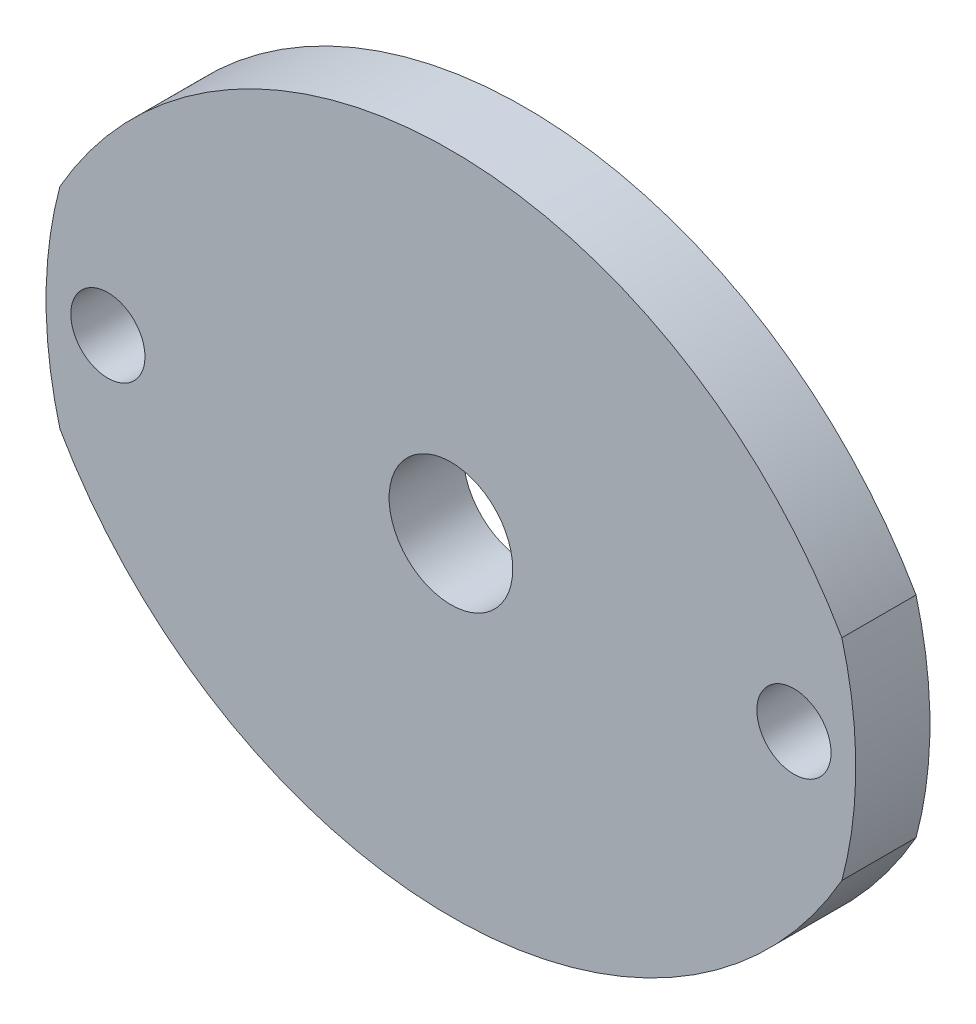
from build123d import *

# Parameters (mm, degrees)
SKETCH1_R           = 2.5
SKETCH1_R_2         = 1.5
BOSS_EXTRUDE1_DEPTH = 3


with BuildPart() as part:
    # Sketch1 → Boss-Extrude1 (new body)
    with BuildSketch(Plane.XY):
        with BuildLine():
            ThreePointArc((2.386362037, 4.024192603), (1.825187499, -0.22593084), (2.386362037, -4.476054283))
            ThreePointArc((2.386362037, -4.476054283), (18.200187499, -13.65093084), (34.01401296, -4.476054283))
            ThreePointArc((34.01401296, -4.476054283), (34.575187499, -0.22593084), (34.01401296, 4.024192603))
            ThreePointArc((34.01401296, 4.024192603), (18.200187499, 13.19906916), (2.386362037, 4.024192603))
        make_face()
        with Locations((18.200187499, -0.22593084)):
            Circle(SKETCH1_R, mode=Mode.SUBTRACT)
        with Locations((32.075187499, -0.22593084)):
            Circle(SKETCH1_R_2, mode=Mode.SUBTRACT)
        with Locations((4.325187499, -0.22593084)):
            Circle(SKETCH1_R_2, mode=Mode.SUBTRACT)
    extrude(amount=BOSS_EXTRUDE1_DEPTH)


solid = part.part
